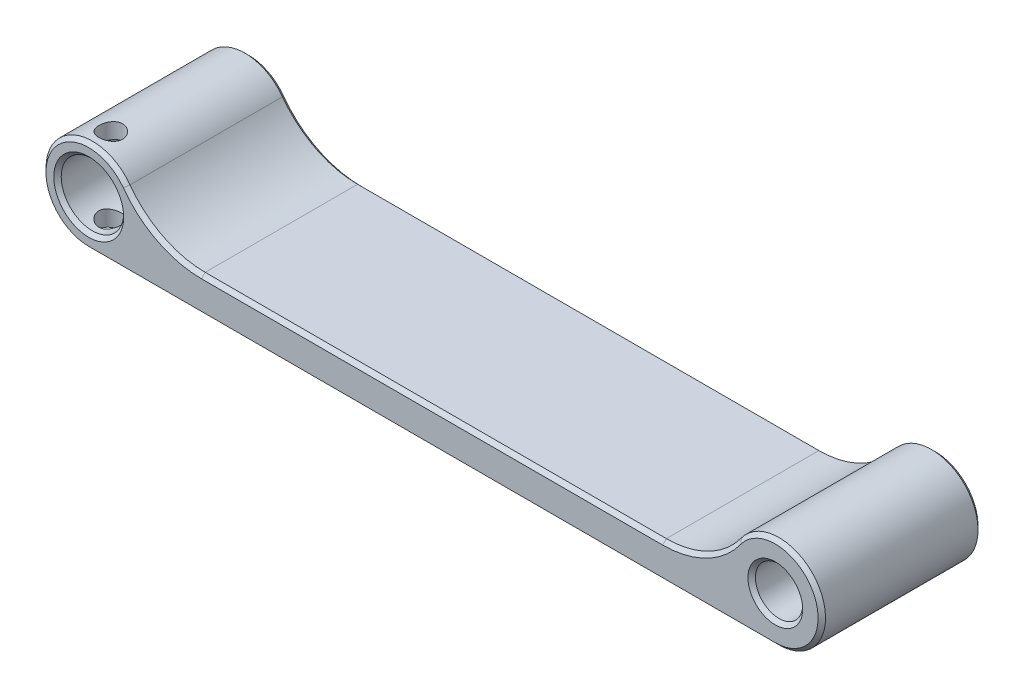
from build123d import *

# Parameters (mm, degrees)
SKETCH1_R           = 1.6129
SKETCH1_R_2         = 1.5875
BOSS_EXTRUDE1_DEPTH = 10.922
SKETCH2_R           = 2.1336
CUT_EXTRUDE1_DEPTH  = 8.8138
SKETCH4_R           = 0.8128
CUT_EXTRUDE2_DEPTH  = 12.2682
CHAMFER1_SIZE       = 0.254


with BuildPart() as part:
    # Sketch1 → Boss-Extrude1 (new body)
    with BuildSketch(Plane.XY):
        with BuildLine():
            Line((3.175, 0), (50.0634, 0))
            ThreePointArc((50.0634, 0), (52.893724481, 4.61371065), (47.498349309, 5.046133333))
            ThreePointArc((47.498349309, 5.046133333), (45.245669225, 3.127751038), (42.368247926, 2.4384))
            Line((42.368247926, 2.4384), (10.870152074, 2.4384))
            ThreePointArc((10.870152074, 2.4384), (7.992730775, 3.127751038), (5.740050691, 5.046133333))
            ThreePointArc((5.740050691, 5.046133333), (0.344675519, 4.61371065), (3.175, 0))
        make_face()
        with Locations((50.0634, 3.175)):
            Circle(SKETCH1_R, mode=Mode.SUBTRACT)
        with Locations((3.175, 3.175)):
            Circle(SKETCH1_R_2, mode=Mode.SUBTRACT)
    extrude(amount=BOSS_EXTRUDE1_DEPTH)

    # Sketch2 → Cut-Extrude1 (cut)
    with BuildSketch(Plane.XY.offset(10.922)):
        with Locations((3.175, 3.175)):
            Circle(SKETCH2_R)
    extrude(amount=-CUT_EXTRUDE1_DEPTH, mode=Mode.SUBTRACT)

    # Sketch4 → Cut-Extrude2 (cut)
    with BuildSketch(Plane.XZ):
        with Locations(Location((3.175, 9.4234, 0), (0, 0, 270))):
            Circle(SKETCH4_R)
    extrude(amount=-CUT_EXTRUDE2_DEPTH, mode=Mode.SUBTRACT)

    # Chamfer1
    chamfer1_edges = [part.edges().sort_by_distance(p)[0] for p in [
        (26.6192, 0, 10.922),
        (52.893724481, 4.61371065, 10.922),
        (45.245669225, 3.127751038, 10.922),
        (48.4505, 3.175, 0),
        (48.4505, 3.175, 10.922),
        (26.6192, 2.4384, 10.922),
        (1.5875, 3.175, 0),
        (1.0414, 3.175, 10.922),
        (7.992730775, 3.127751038, 10.922),
        (26.6192, 2.4384, 0),
        (45.245669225, 3.127751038, 0),
        (52.893724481, 4.61371065, 0),
        (0.344675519, 4.61371065, 10.922),
        (26.6192, 0, 0),
        (0.344675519, 4.61371065, 0),
        (7.992730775, 3.127751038, 0),
    ]]
    chamfer(chamfer1_edges, length=CHAMFER1_SIZE)


solid = part.part
